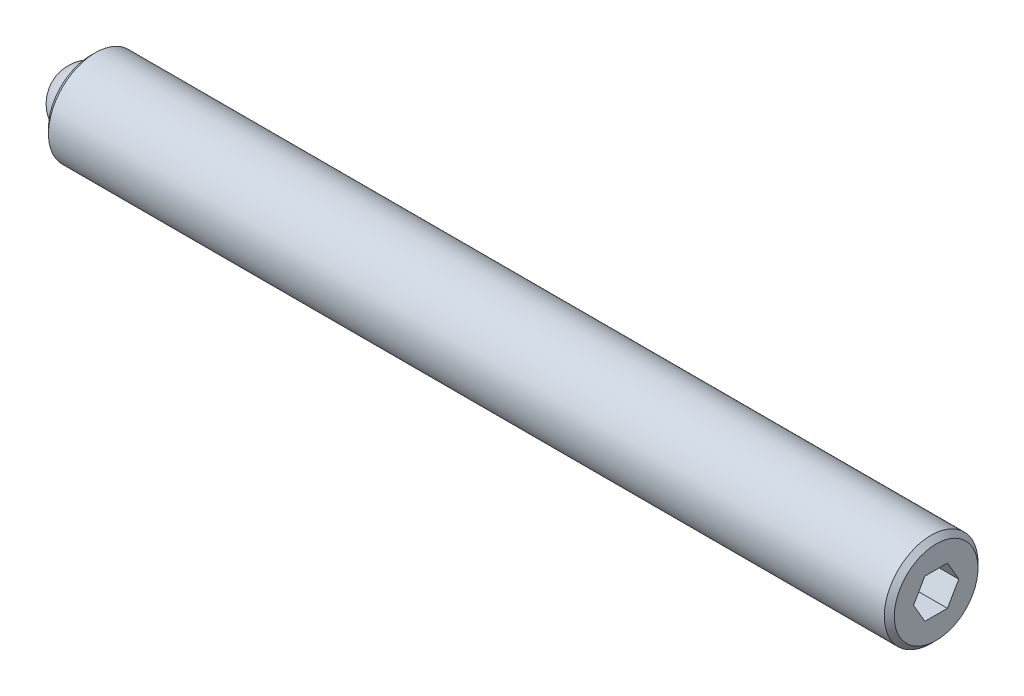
from build123d import *

# Parameters (mm, degrees)
SKETCH2_R           = 2.3749
BOSS_EXTRUDE1_DEPTH = 42.8625
CHAMFER1_SIZE       = 0.254
CHAMFER2_SIZE       = 0.254
CUT_EXTRUDE2_DEPTH  = 2.286
SKETCH3_R           = 1.5875
CUT_EXTRUDE3_DEPTH  = 1.5875


with BuildPart() as part:
    # Sketch2 → Boss-Extrude1 (new body)
    with BuildSketch(Plane(origin=(0, 0, 0), x_dir=(0, 0, -1), z_dir=(1, 0, 0))):
        Circle(SKETCH2_R)
    extrude(amount=BOSS_EXTRUDE1_DEPTH)

    # Chamfer1
    chamfer1_edges = [part.edges().sort_by_distance(p)[0] for p in [
        (0, 0, 2.3749),
    ]]
    chamfer(chamfer1_edges, length=CHAMFER1_SIZE)

    # Chamfer2
    chamfer2_edges = [part.edges().sort_by_distance(p)[0] for p in [
        (42.8625, 0, 2.3749),
    ]]
    chamfer(chamfer2_edges, length=CHAMFER2_SIZE)

    # Sketch4 → Cut-Extrude2 (cut)
    with BuildSketch(Plane(origin=(42.8625, 0, 0), x_dir=(0, 0, -1), z_dir=(1, 0, 0))):
        Polygon((1.14567944, 0), (0.57283972, 0.9921875), (-0.57283972, 0.9921875), (-1.14567944, 0), (-0.57283972, -0.9921875), (0.57283972, -0.9921875), align=None)
    extrude(amount=-CUT_EXTRUDE2_DEPTH, mode=Mode.SUBTRACT)

    # Sketch3 → Cut-Extrude3 (cut)
    with BuildSketch(Plane.ZY):
        Circle(SKETCH3_R)
    extrude(amount=-CUT_EXTRUDE3_DEPTH, mode=Mode.SUBTRACT)


with BuildPart() as body_2:
    # Sketch5 → Revolve1 (revolve)
    with BuildSketch(Plane.ZY):
        with BuildLine():
            Line((0, 0), (0, -1.5875))
            ThreePointArc((0, -1.5875), (-1.5875, 0), (0, 1.5875))
            Line((0, 1.5875), (0, 0))
        make_face()
    revolve(axis=Axis((0, 0, 0), (0, 1, 0)))


solid = Compound([part.part, body_2.part])
